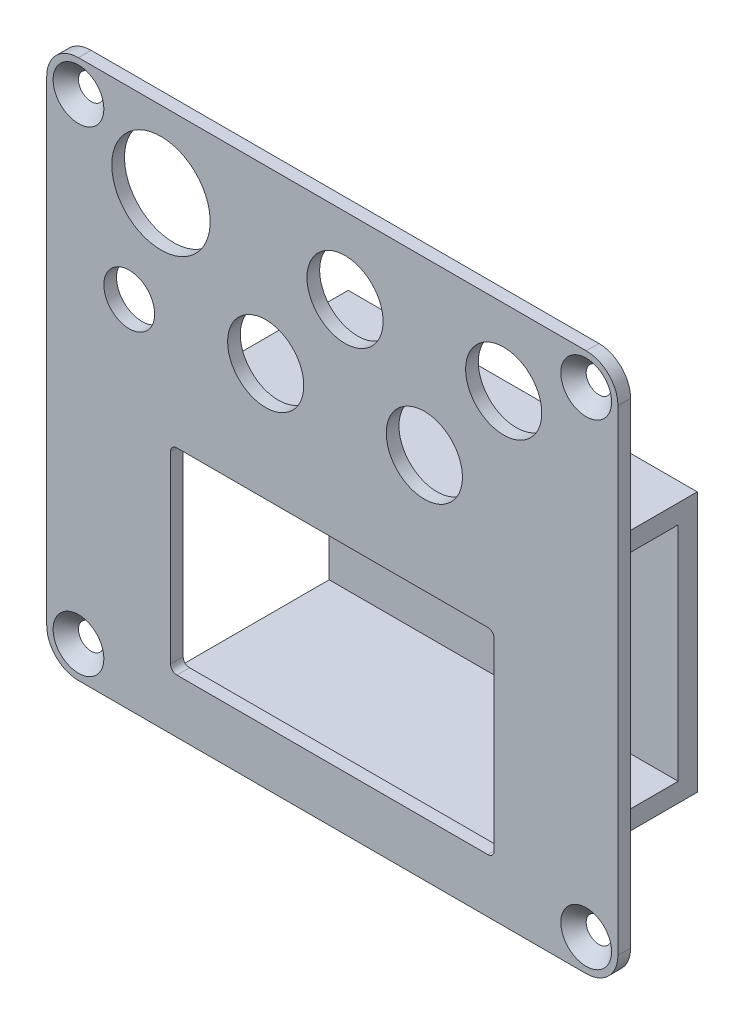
ISO-10303-21;
HEADER;
FILE_DESCRIPTION(('STEP AP214'),'2;1');
FILE_NAME('part.step','',(''),(''),'','','');
FILE_SCHEMA(('AUTOMOTIVE_DESIGN { 1 0 10303 214 1 1 1 1 }'));
ENDSEC;
DATA;
#1=APPLICATION_CONTEXT('core data for automotive mechanical design processes');
#2=APPLICATION_PROTOCOL_DEFINITION('international standard','automotive_design',2000,#1);
#3=PRODUCT_CONTEXT('',#1,'mechanical');
#4=PRODUCT('Part','Part','',(#3));
#5=PRODUCT_RELATED_PRODUCT_CATEGORY('part','',(#4));
#6=PRODUCT_DEFINITION_FORMATION('','',#4);
#7=PRODUCT_DEFINITION_CONTEXT('part definition',#1,'design');
#8=PRODUCT_DEFINITION('design','',#6,#7);
#9=PRODUCT_DEFINITION_SHAPE('','',#8);
#10=(LENGTH_UNIT() NAMED_UNIT(*) SI_UNIT(.MILLI.,.METRE.));
#11=(NAMED_UNIT(*) PLANE_ANGLE_UNIT() SI_UNIT($,.RADIAN.));
#12=(NAMED_UNIT(*) SI_UNIT($,.STERADIAN.) SOLID_ANGLE_UNIT());
#13=UNCERTAINTY_MEASURE_WITH_UNIT(LENGTH_MEASURE(1.E-05),#10,'distance_accuracy_value','');
#14=(GEOMETRIC_REPRESENTATION_CONTEXT(3) GLOBAL_UNCERTAINTY_ASSIGNED_CONTEXT((#13)) GLOBAL_UNIT_ASSIGNED_CONTEXT((#10,
#11,#12)) REPRESENTATION_CONTEXT('',''));
#15=CARTESIAN_POINT('',(0.,0.,0.));
#16=DIRECTION('',(0.,0.,1.));
#17=DIRECTION('',(1.,0.,0.));
#18=AXIS2_PLACEMENT_3D('',#15,#16,#17);
#19=CARTESIAN_POINT('',(40.,-37.5,0.));
#20=DIRECTION('',(0.,0.,1.));
#21=DIRECTION('',(1.,0.,0.));
#22=AXIS2_PLACEMENT_3D('',#19,#20,#21);
#23=PLANE('',#22);
#24=CARTESIAN_POINT('',(-32.,13.5,0.));
#25=DIRECTION('',(0.,0.,-1.));
#26=DIRECTION('',(-1.,0.,0.));
#27=AXIS2_PLACEMENT_3D('',#24,#25,#26);
#28=CIRCLE('',#27,4.);
#29=CARTESIAN_POINT('',(-36.,13.5,0.));
#30=VERTEX_POINT('',#29);
#31=EDGE_CURVE('E651',#30,#30,#28,.T.);
#32=ORIENTED_EDGE('',*,*,#31,.F.);
#33=EDGE_LOOP('',(#32));
#34=FACE_BOUND('',#33,.T.);
#35=CARTESIAN_POINT('',(27.,30.5,0.));
#36=DIRECTION('',(0.,0.,-1.));
#37=DIRECTION('',(-1.,0.,0.));
#38=AXIS2_PLACEMENT_3D('',#35,#36,#37);
#39=CIRCLE('',#38,6.);
#40=CARTESIAN_POINT('',(21.,30.5,0.));
#41=VERTEX_POINT('',#40);
#42=EDGE_CURVE('E647',#41,#41,#39,.T.);
#43=ORIENTED_EDGE('',*,*,#42,.F.);
#44=EDGE_LOOP('',(#43));
#45=FACE_BOUND('',#44,.T.);
#46=CARTESIAN_POINT('',(14.5,15.5,0.));
#47=DIRECTION('',(0.,0.,-1.));
#48=DIRECTION('',(-1.,0.,0.));
#49=AXIS2_PLACEMENT_3D('',#46,#47,#48);
#50=CIRCLE('',#49,6.);
#51=CARTESIAN_POINT('',(8.49999999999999,15.5,0.));
#52=VERTEX_POINT('',#51);
#53=EDGE_CURVE('E643',#52,#52,#50,.T.);
#54=ORIENTED_EDGE('',*,*,#53,.F.);
#55=EDGE_LOOP('',(#54));
#56=FACE_BOUND('',#55,.T.);
#57=CARTESIAN_POINT('',(2.,30.5,0.));
#58=DIRECTION('',(0.,0.,-1.));
#59=DIRECTION('',(-1.,0.,0.));
#60=AXIS2_PLACEMENT_3D('',#57,#58,#59);
#61=CIRCLE('',#60,6.);
#62=CARTESIAN_POINT('',(-4.,30.5,0.));
#63=VERTEX_POINT('',#62);
#64=EDGE_CURVE('E639',#63,#63,#61,.T.);
#65=ORIENTED_EDGE('',*,*,#64,.F.);
#66=EDGE_LOOP('',(#65));
#67=FACE_BOUND('',#66,.T.);
#68=CARTESIAN_POINT('',(-10.5,15.5,0.));
#69=DIRECTION('',(0.,0.,-1.));
#70=DIRECTION('',(-1.,0.,0.));
#71=AXIS2_PLACEMENT_3D('',#68,#69,#70);
#72=CIRCLE('',#71,6.);
#73=CARTESIAN_POINT('',(-16.5,15.5,0.));
#74=VERTEX_POINT('',#73);
#75=EDGE_CURVE('E633',#74,#74,#72,.T.);
#76=ORIENTED_EDGE('',*,*,#75,.F.);
#77=EDGE_LOOP('',(#76));
#78=FACE_BOUND('',#77,.T.);
#79=CARTESIAN_POINT('',(-27.,30.5,0.));
#80=DIRECTION('',(0.,0.,-1.));
#81=DIRECTION('',(-1.,0.,0.));
#82=AXIS2_PLACEMENT_3D('',#79,#80,#81);
#83=CIRCLE('',#82,7.75);
#84=CARTESIAN_POINT('',(-34.75,30.5,0.));
#85=VERTEX_POINT('',#84);
#86=EDGE_CURVE('E232',#85,#85,#83,.T.);
#87=ORIENTED_EDGE('',*,*,#86,.F.);
#88=EDGE_LOOP('',(#87));
#89=FACE_BOUND('',#88,.T.);
#90=DIRECTION('',(1.,0.,0.));
#91=VECTOR('',#90,1.);
#92=CARTESIAN_POINT('',(25.5,-3.,0.));
#93=LINE('',#92,#91);
#94=CARTESIAN_POINT('',(-24.5,-3.,0.));
#95=VERTEX_POINT('',#94);
#96=CARTESIAN_POINT('',(24.5,-3.,0.));
#97=VERTEX_POINT('',#96);
#98=EDGE_CURVE('E255',#95,#97,#93,.T.);
#99=ORIENTED_EDGE('',*,*,#98,.F.);
#100=CARTESIAN_POINT('',(-24.5,-4.,0.));
#101=DIRECTION('',(0.,0.,1.));
#102=DIRECTION('',(1.,0.,0.));
#103=AXIS2_PLACEMENT_3D('',#100,#101,#102);
#104=CIRCLE('',#103,1.);
#105=CARTESIAN_POINT('',(-25.5,-4.,0.));
#106=VERTEX_POINT('',#105);
#107=EDGE_CURVE('E413',#95,#106,#104,.T.);
#108=ORIENTED_EDGE('',*,*,#107,.T.);
#109=DIRECTION('',(0.,1.,0.));
#110=VECTOR('',#109,1.);
#111=CARTESIAN_POINT('',(-25.5,-3.,0.));
#112=LINE('',#111,#110);
#113=CARTESIAN_POINT('',(-25.5,-33.,0.));
#114=VERTEX_POINT('',#113);
#115=EDGE_CURVE('E237',#114,#106,#112,.T.);
#116=ORIENTED_EDGE('',*,*,#115,.F.);
#117=CARTESIAN_POINT('',(-24.5,-33.,0.));
#118=DIRECTION('',(0.,0.,1.));
#119=DIRECTION('',(1.,0.,0.));
#120=AXIS2_PLACEMENT_3D('',#117,#118,#119);
#121=CIRCLE('',#120,1.);
#122=CARTESIAN_POINT('',(-24.5,-34.,0.));
#123=VERTEX_POINT('',#122);
#124=EDGE_CURVE('E409',#114,#123,#121,.T.);
#125=ORIENTED_EDGE('',*,*,#124,.T.);
#126=DIRECTION('',(-1.,0.,0.));
#127=VECTOR('',#126,1.);
#128=CARTESIAN_POINT('',(25.5,-34.,0.));
#129=LINE('',#128,#127);
#130=CARTESIAN_POINT('',(24.5,-34.,0.));
#131=VERTEX_POINT('',#130);
#132=EDGE_CURVE('E244',#131,#123,#129,.T.);
#133=ORIENTED_EDGE('',*,*,#132,.F.);
#134=CARTESIAN_POINT('',(24.5,-33.,0.));
#135=DIRECTION('',(0.,0.,1.));
#136=DIRECTION('',(1.,0.,0.));
#137=AXIS2_PLACEMENT_3D('',#134,#135,#136);
#138=CIRCLE('',#137,1.);
#139=CARTESIAN_POINT('',(25.5,-33.,0.));
#140=VERTEX_POINT('',#139);
#141=EDGE_CURVE('E405',#131,#140,#138,.T.);
#142=ORIENTED_EDGE('',*,*,#141,.T.);
#143=DIRECTION('',(0.,-1.,0.));
#144=VECTOR('',#143,1.);
#145=CARTESIAN_POINT('',(25.5,-3.,0.));
#146=LINE('',#145,#144);
#147=CARTESIAN_POINT('',(25.5,-4.,0.));
#148=VERTEX_POINT('',#147);
#149=EDGE_CURVE('E257',#148,#140,#146,.T.);
#150=ORIENTED_EDGE('',*,*,#149,.F.);
#151=CARTESIAN_POINT('',(24.5,-4.,0.));
#152=DIRECTION('',(0.,0.,1.));
#153=DIRECTION('',(1.,0.,0.));
#154=AXIS2_PLACEMENT_3D('',#151,#152,#153);
#155=CIRCLE('',#154,1.);
#156=EDGE_CURVE('E45',#148,#97,#155,.T.);
#157=ORIENTED_EDGE('',*,*,#156,.T.);
#158=EDGE_LOOP('',(#99,#108,#116,#125,#133,#142,#150,#157));
#159=FACE_BOUND('',#158,.T.);
#160=DIRECTION('',(0.,1.,0.));
#161=VECTOR('',#160,1.);
#162=CARTESIAN_POINT('',(-27.5,-36.,0.));
#163=LINE('',#162,#161);
#164=CARTESIAN_POINT('',(-27.5,-39.,0.));
#165=VERTEX_POINT('',#164);
#166=CARTESIAN_POINT('',(-27.5,-36.,0.));
#167=VERTEX_POINT('',#166);
#168=EDGE_CURVE('E287',#165,#167,#163,.T.);
#169=ORIENTED_EDGE('',*,*,#168,.F.);
#170=DIRECTION('',(-1.,0.,0.));
#171=VECTOR('',#170,1.);
#172=CARTESIAN_POINT('',(27.5,-39.,0.));
#173=LINE('',#172,#171);
#174=CARTESIAN_POINT('',(27.5,-39.,0.));
#175=VERTEX_POINT('',#174);
#176=EDGE_CURVE('E291',#175,#165,#173,.T.);
#177=ORIENTED_EDGE('',*,*,#176,.F.);
#178=DIRECTION('',(0.,-1.,0.));
#179=VECTOR('',#178,1.);
#180=CARTESIAN_POINT('',(27.5,-36.,0.));
#181=LINE('',#180,#179);
#182=CARTESIAN_POINT('',(27.5,-36.,0.));
#183=VERTEX_POINT('',#182);
#184=EDGE_CURVE('E207',#183,#175,#181,.T.);
#185=ORIENTED_EDGE('',*,*,#184,.F.);
#186=DIRECTION('',(1.,0.,0.));
#187=VECTOR('',#186,1.);
#188=CARTESIAN_POINT('',(27.5,-36.,0.));
#189=LINE('',#188,#187);
#190=EDGE_CURVE('E294',#167,#183,#189,.T.);
#191=ORIENTED_EDGE('',*,*,#190,.F.);
#192=EDGE_LOOP('',(#169,#177,#185,#191));
#193=FACE_BOUND('',#192,.T.);
#194=CARTESIAN_POINT('',(-40.,-37.5,0.));
#195=DIRECTION('',(0.,0.,1.));
#196=DIRECTION('',(1.,0.,0.));
#197=AXIS2_PLACEMENT_3D('',#194,#195,#196);
#198=CIRCLE('',#197,2.);
#199=CARTESIAN_POINT('',(-38.,-37.5,0.));
#200=VERTEX_POINT('',#199);
#201=EDGE_CURVE('E304',#200,#200,#198,.T.);
#202=ORIENTED_EDGE('',*,*,#201,.T.);
#203=EDGE_LOOP('',(#202));
#204=FACE_BOUND('',#203,.T.);
#205=CARTESIAN_POINT('',(40.,-37.5,0.));
#206=DIRECTION('',(0.,0.,1.));
#207=DIRECTION('',(1.,0.,0.));
#208=AXIS2_PLACEMENT_3D('',#205,#206,#207);
#209=CIRCLE('',#208,2.);
#210=CARTESIAN_POINT('',(42.,-37.5,0.));
#211=VERTEX_POINT('',#210);
#212=EDGE_CURVE('E309',#211,#211,#209,.T.);
#213=ORIENTED_EDGE('',*,*,#212,.T.);
#214=EDGE_LOOP('',(#213));
#215=FACE_BOUND('',#214,.T.);
#216=CARTESIAN_POINT('',(40.,37.5,0.));
#217=DIRECTION('',(0.,0.,1.));
#218=DIRECTION('',(1.,0.,0.));
#219=AXIS2_PLACEMENT_3D('',#216,#217,#218);
#220=CIRCLE('',#219,2.);
#221=CARTESIAN_POINT('',(42.,37.5,0.));
#222=VERTEX_POINT('',#221);
#223=EDGE_CURVE('E305',#222,#222,#220,.T.);
#224=ORIENTED_EDGE('',*,*,#223,.T.);
#225=EDGE_LOOP('',(#224));
#226=FACE_BOUND('',#225,.T.);
#227=CARTESIAN_POINT('',(-40.,37.5,0.));
#228=DIRECTION('',(0.,0.,1.));
#229=DIRECTION('',(1.,0.,0.));
#230=AXIS2_PLACEMENT_3D('',#227,#228,#229);
#231=CIRCLE('',#230,2.);
#232=CARTESIAN_POINT('',(-38.,37.5,0.));
#233=VERTEX_POINT('',#232);
#234=EDGE_CURVE('E308',#233,#233,#231,.T.);
#235=ORIENTED_EDGE('',*,*,#234,.T.);
#236=EDGE_LOOP('',(#235));
#237=FACE_BOUND('',#236,.T.);
#238=CARTESIAN_POINT('',(40.,-37.5,0.));
#239=DIRECTION('',(0.,0.,1.));
#240=DIRECTION('',(1.,0.,0.));
#241=AXIS2_PLACEMENT_3D('',#238,#239,#240);
#242=CIRCLE('',#241,5.);
#243=CARTESIAN_POINT('',(40.,-42.5,0.));
#244=VERTEX_POINT('',#243);
#245=CARTESIAN_POINT('',(45.,-37.5,0.));
#246=VERTEX_POINT('',#245);
#247=EDGE_CURVE('E316',#244,#246,#242,.T.);
#248=ORIENTED_EDGE('',*,*,#247,.F.);
#249=DIRECTION('',(1.,0.,0.));
#250=VECTOR('',#249,1.);
#251=CARTESIAN_POINT('',(-40.,-42.5,0.));
#252=LINE('',#251,#250);
#253=CARTESIAN_POINT('',(-40.,-42.5,0.));
#254=VERTEX_POINT('',#253);
#255=EDGE_CURVE('E321',#254,#244,#252,.T.);
#256=ORIENTED_EDGE('',*,*,#255,.F.);
#257=CARTESIAN_POINT('',(-40.,-37.5,0.));
#258=DIRECTION('',(0.,0.,1.));
#259=DIRECTION('',(1.,0.,0.));
#260=AXIS2_PLACEMENT_3D('',#257,#258,#259);
#261=CIRCLE('',#260,5.);
#262=CARTESIAN_POINT('',(-45.,-37.5,0.));
#263=VERTEX_POINT('',#262);
#264=EDGE_CURVE('E348',#263,#254,#261,.T.);
#265=ORIENTED_EDGE('',*,*,#264,.F.);
#266=DIRECTION('',(0.,-1.,0.));
#267=VECTOR('',#266,1.);
#268=CARTESIAN_POINT('',(-45.,37.5,0.));
#269=LINE('',#268,#267);
#270=CARTESIAN_POINT('',(-45.,37.5,0.));
#271=VERTEX_POINT('',#270);
#272=EDGE_CURVE('E346',#271,#263,#269,.T.);
#273=ORIENTED_EDGE('',*,*,#272,.F.);
#274=CARTESIAN_POINT('',(-40.,37.5,0.));
#275=DIRECTION('',(0.,0.,1.));
#276=DIRECTION('',(1.,0.,0.));
#277=AXIS2_PLACEMENT_3D('',#274,#275,#276);
#278=CIRCLE('',#277,5.);
#279=CARTESIAN_POINT('',(-40.,42.5,0.));
#280=VERTEX_POINT('',#279);
#281=EDGE_CURVE('E344',#280,#271,#278,.T.);
#282=ORIENTED_EDGE('',*,*,#281,.F.);
#283=DIRECTION('',(-1.,0.,0.));
#284=VECTOR('',#283,1.);
#285=CARTESIAN_POINT('',(-40.,42.5,0.));
#286=LINE('',#285,#284);
#287=CARTESIAN_POINT('',(39.9999999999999,42.5,0.));
#288=VERTEX_POINT('',#287);
#289=EDGE_CURVE('E342',#288,#280,#286,.T.);
#290=ORIENTED_EDGE('',*,*,#289,.F.);
#291=CARTESIAN_POINT('',(40.,37.5,0.));
#292=DIRECTION('',(0.,0.,1.));
#293=DIRECTION('',(-1.,0.,0.));
#294=AXIS2_PLACEMENT_3D('',#291,#292,#293);
#295=CIRCLE('',#294,5.);
#296=CARTESIAN_POINT('',(45.,37.5,0.));
#297=VERTEX_POINT('',#296);
#298=EDGE_CURVE('E340',#297,#288,#295,.T.);
#299=ORIENTED_EDGE('',*,*,#298,.F.);
#300=DIRECTION('',(0.,1.,0.));
#301=VECTOR('',#300,1.);
#302=CARTESIAN_POINT('',(45.,37.5,0.));
#303=LINE('',#302,#301);
#304=EDGE_CURVE('E338',#246,#297,#303,.T.);
#305=ORIENTED_EDGE('',*,*,#304,.F.);
#306=EDGE_LOOP('',(#248,#256,#265,#273,#282,#290,#299,#305));
#307=FACE_BOUND('',#306,.T.);
#308=DIRECTION('',(0.,1.,0.));
#309=VECTOR('',#308,1.);
#310=CARTESIAN_POINT('',(-27.5,2.,0.));
#311=LINE('',#310,#309);
#312=CARTESIAN_POINT('',(-27.5,-1.,0.));
#313=VERTEX_POINT('',#312);
#314=CARTESIAN_POINT('',(-27.5,2.,0.));
#315=VERTEX_POINT('',#314);
#316=EDGE_CURVE('E252',#313,#315,#311,.T.);
#317=ORIENTED_EDGE('',*,*,#316,.F.);
#318=DIRECTION('',(-1.,0.,0.));
#319=VECTOR('',#318,1.);
#320=CARTESIAN_POINT('',(27.5,-1.,0.));
#321=LINE('',#320,#319);
#322=CARTESIAN_POINT('',(27.5,-1.,0.));
#323=VERTEX_POINT('',#322);
#324=EDGE_CURVE('E266',#323,#313,#321,.T.);
#325=ORIENTED_EDGE('',*,*,#324,.F.);
#326=DIRECTION('',(0.,-1.,0.));
#327=VECTOR('',#326,1.);
#328=CARTESIAN_POINT('',(27.5,2.,0.));
#329=LINE('',#328,#327);
#330=CARTESIAN_POINT('',(27.5,1.99999999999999,0.));
#331=VERTEX_POINT('',#330);
#332=EDGE_CURVE('E272',#331,#323,#329,.T.);
#333=ORIENTED_EDGE('',*,*,#332,.F.);
#334=DIRECTION('',(1.,0.,0.));
#335=VECTOR('',#334,1.);
#336=CARTESIAN_POINT('',(27.5,2.,0.));
#337=LINE('',#336,#335);
#338=EDGE_CURVE('E269',#315,#331,#337,.T.);
#339=ORIENTED_EDGE('',*,*,#338,.F.);
#340=EDGE_LOOP('',(#317,#325,#333,#339));
#341=FACE_BOUND('',#340,.T.);
#342=ADVANCED_FACE('F37',(#34,#45,#56,#67,#78,#89,#159,#193,#204,#215,#226,#237,#307,#341),#23,.F.);
#343=CARTESIAN_POINT('',(40.,-37.5,2.));
#344=DIRECTION('',(0.,0.,-1.));
#345=DIRECTION('',(-1.,0.,0.));
#346=AXIS2_PLACEMENT_3D('',#343,#344,#345);
#347=CYLINDRICAL_SURFACE('',#346,5.);
#348=ORIENTED_EDGE('',*,*,#247,.T.);
#349=DIRECTION('',(0.,0.,-1.));
#350=VECTOR('',#349,1.);
#351=CARTESIAN_POINT('',(45.,-37.5,2.));
#352=LINE('',#351,#350);
#353=CARTESIAN_POINT('',(45.,-37.5,2.));
#354=VERTEX_POINT('',#353);
#355=EDGE_CURVE('E371',#354,#246,#352,.T.);
#356=ORIENTED_EDGE('',*,*,#355,.F.);
#357=CARTESIAN_POINT('',(40.,-37.5,2.));
#358=DIRECTION('',(0.,0.,1.));
#359=DIRECTION('',(1.,0.,0.));
#360=AXIS2_PLACEMENT_3D('',#357,#358,#359);
#361=CIRCLE('',#360,5.);
#362=CARTESIAN_POINT('',(40.,-42.5,2.));
#363=VERTEX_POINT('',#362);
#364=EDGE_CURVE('E317',#363,#354,#361,.T.);
#365=ORIENTED_EDGE('',*,*,#364,.F.);
#366=DIRECTION('',(0.,0.,-1.));
#367=VECTOR('',#366,1.);
#368=CARTESIAN_POINT('',(40.,-42.5,2.));
#369=LINE('',#368,#367);
#370=EDGE_CURVE('E335',#363,#244,#369,.T.);
#371=ORIENTED_EDGE('',*,*,#370,.T.);
#372=EDGE_LOOP('',(#348,#356,#365,#371));
#373=FACE_BOUND('',#372,.T.);
#374=ADVANCED_FACE('F458',(#373),#347,.T.);
#375=CARTESIAN_POINT('',(45.,37.5,2.));
#376=DIRECTION('',(-1.,0.,0.));
#377=DIRECTION('',(0.,-1.,0.));
#378=AXIS2_PLACEMENT_3D('',#375,#376,#377);
#379=PLANE('',#378);
#380=ORIENTED_EDGE('',*,*,#304,.T.);
#381=DIRECTION('',(0.,0.,-1.));
#382=VECTOR('',#381,1.);
#383=CARTESIAN_POINT('',(45.,37.5,2.));
#384=LINE('',#383,#382);
#385=CARTESIAN_POINT('',(45.,37.5,2.));
#386=VERTEX_POINT('',#385);
#387=EDGE_CURVE('E368',#386,#297,#384,.T.);
#388=ORIENTED_EDGE('',*,*,#387,.F.);
#389=DIRECTION('',(0.,1.,0.));
#390=VECTOR('',#389,1.);
#391=CARTESIAN_POINT('',(45.,37.5,2.));
#392=LINE('',#391,#390);
#393=EDGE_CURVE('E320',#354,#386,#392,.T.);
#394=ORIENTED_EDGE('',*,*,#393,.F.);
#395=ORIENTED_EDGE('',*,*,#355,.T.);
#396=EDGE_LOOP('',(#380,#388,#394,#395));
#397=FACE_BOUND('',#396,.T.);
#398=ADVANCED_FACE('F464',(#397),#379,.F.);
#399=CARTESIAN_POINT('',(40.,37.5,2.));
#400=DIRECTION('',(0.,0.,-1.));
#401=DIRECTION('',(-1.,0.,0.));
#402=AXIS2_PLACEMENT_3D('',#399,#400,#401);
#403=CYLINDRICAL_SURFACE('',#402,5.);
#404=ORIENTED_EDGE('',*,*,#298,.T.);
#405=DIRECTION('',(0.,0.,-1.));
#406=VECTOR('',#405,1.);
#407=CARTESIAN_POINT('',(39.9999999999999,42.5,2.));
#408=LINE('',#407,#406);
#409=CARTESIAN_POINT('',(39.9999999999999,42.5,2.));
#410=VERTEX_POINT('',#409);
#411=EDGE_CURVE('E365',#410,#288,#408,.T.);
#412=ORIENTED_EDGE('',*,*,#411,.F.);
#413=CARTESIAN_POINT('',(40.,37.5,2.));
#414=DIRECTION('',(0.,0.,1.));
#415=DIRECTION('',(-1.,0.,0.));
#416=AXIS2_PLACEMENT_3D('',#413,#414,#415);
#417=CIRCLE('',#416,5.);
#418=EDGE_CURVE('E323',#386,#410,#417,.T.);
#419=ORIENTED_EDGE('',*,*,#418,.F.);
#420=ORIENTED_EDGE('',*,*,#387,.T.);
#421=EDGE_LOOP('',(#404,#412,#419,#420));
#422=FACE_BOUND('',#421,.T.);
#423=ADVANCED_FACE('F491',(#422),#403,.T.);
#424=CARTESIAN_POINT('',(-40.,42.5,2.));
#425=DIRECTION('',(0.,-1.,0.));
#426=DIRECTION('',(0.,0.,-1.));
#427=AXIS2_PLACEMENT_3D('',#424,#425,#426);
#428=PLANE('',#427);
#429=ORIENTED_EDGE('',*,*,#289,.T.);
#430=DIRECTION('',(0.,0.,-1.));
#431=VECTOR('',#430,1.);
#432=CARTESIAN_POINT('',(-40.,42.5,2.));
#433=LINE('',#432,#431);
#434=CARTESIAN_POINT('',(-40.,42.5,2.));
#435=VERTEX_POINT('',#434);
#436=EDGE_CURVE('E362',#435,#280,#433,.T.);
#437=ORIENTED_EDGE('',*,*,#436,.F.);
#438=DIRECTION('',(-1.,0.,0.));
#439=VECTOR('',#438,1.);
#440=CARTESIAN_POINT('',(-40.,42.5,2.));
#441=LINE('',#440,#439);
#442=EDGE_CURVE('E325',#410,#435,#441,.T.);
#443=ORIENTED_EDGE('',*,*,#442,.F.);
#444=ORIENTED_EDGE('',*,*,#411,.T.);
#445=EDGE_LOOP('',(#429,#437,#443,#444));
#446=FACE_BOUND('',#445,.T.);
#447=ADVANCED_FACE('F487',(#446),#428,.F.);
#448=CARTESIAN_POINT('',(-40.,37.5,2.));
#449=DIRECTION('',(0.,0.,-1.));
#450=DIRECTION('',(-1.,0.,0.));
#451=AXIS2_PLACEMENT_3D('',#448,#449,#450);
#452=CYLINDRICAL_SURFACE('',#451,5.);
#453=ORIENTED_EDGE('',*,*,#281,.T.);
#454=DIRECTION('',(0.,0.,-1.));
#455=VECTOR('',#454,1.);
#456=CARTESIAN_POINT('',(-45.,37.5,2.));
#457=LINE('',#456,#455);
#458=CARTESIAN_POINT('',(-45.,37.5,2.));
#459=VERTEX_POINT('',#458);
#460=EDGE_CURVE('E359',#459,#271,#457,.T.);
#461=ORIENTED_EDGE('',*,*,#460,.F.);
#462=CARTESIAN_POINT('',(-40.,37.5,2.));
#463=DIRECTION('',(0.,0.,1.));
#464=DIRECTION('',(1.,0.,0.));
#465=AXIS2_PLACEMENT_3D('',#462,#463,#464);
#466=CIRCLE('',#465,5.);
#467=EDGE_CURVE('E327',#435,#459,#466,.T.);
#468=ORIENTED_EDGE('',*,*,#467,.F.);
#469=ORIENTED_EDGE('',*,*,#436,.T.);
#470=EDGE_LOOP('',(#453,#461,#468,#469));
#471=FACE_BOUND('',#470,.T.);
#472=ADVANCED_FACE('F483',(#471),#452,.T.);
#473=CARTESIAN_POINT('',(-45.,37.5,2.));
#474=DIRECTION('',(1.,0.,0.));
#475=DIRECTION('',(0.,1.,0.));
#476=AXIS2_PLACEMENT_3D('',#473,#474,#475);
#477=PLANE('',#476);
#478=ORIENTED_EDGE('',*,*,#272,.T.);
#479=DIRECTION('',(0.,0.,-1.));
#480=VECTOR('',#479,1.);
#481=CARTESIAN_POINT('',(-45.,-37.5,2.));
#482=LINE('',#481,#480);
#483=CARTESIAN_POINT('',(-45.,-37.5,2.));
#484=VERTEX_POINT('',#483);
#485=EDGE_CURVE('E356',#484,#263,#482,.T.);
#486=ORIENTED_EDGE('',*,*,#485,.F.);
#487=DIRECTION('',(0.,-1.,0.));
#488=VECTOR('',#487,1.);
#489=CARTESIAN_POINT('',(-45.,37.5,2.));
#490=LINE('',#489,#488);
#491=EDGE_CURVE('E329',#459,#484,#490,.T.);
#492=ORIENTED_EDGE('',*,*,#491,.F.);
#493=ORIENTED_EDGE('',*,*,#460,.T.);
#494=EDGE_LOOP('',(#478,#486,#492,#493));
#495=FACE_BOUND('',#494,.T.);
#496=ADVANCED_FACE('F479',(#495),#477,.F.);
#497=CARTESIAN_POINT('',(-40.,-37.5,2.));
#498=DIRECTION('',(0.,0.,-1.));
#499=DIRECTION('',(-1.,0.,0.));
#500=AXIS2_PLACEMENT_3D('',#497,#498,#499);
#501=CYLINDRICAL_SURFACE('',#500,5.);
#502=ORIENTED_EDGE('',*,*,#264,.T.);
#503=DIRECTION('',(0.,0.,-1.));
#504=VECTOR('',#503,1.);
#505=CARTESIAN_POINT('',(-40.,-42.5,2.));
#506=LINE('',#505,#504);
#507=CARTESIAN_POINT('',(-40.,-42.5,2.));
#508=VERTEX_POINT('',#507);
#509=EDGE_CURVE('E353',#508,#254,#506,.T.);
#510=ORIENTED_EDGE('',*,*,#509,.F.);
#511=CARTESIAN_POINT('',(-40.,-37.5,2.));
#512=DIRECTION('',(0.,0.,1.));
#513=DIRECTION('',(1.,0.,0.));
#514=AXIS2_PLACEMENT_3D('',#511,#512,#513);
#515=CIRCLE('',#514,5.);
#516=EDGE_CURVE('E331',#484,#508,#515,.T.);
#517=ORIENTED_EDGE('',*,*,#516,.F.);
#518=ORIENTED_EDGE('',*,*,#485,.T.);
#519=EDGE_LOOP('',(#502,#510,#517,#518));
#520=FACE_BOUND('',#519,.T.);
#521=ADVANCED_FACE('F475',(#520),#501,.T.);
#522=CARTESIAN_POINT('',(-40.,-42.5,2.));
#523=DIRECTION('',(0.,1.,0.));
#524=DIRECTION('',(0.,0.,1.));
#525=AXIS2_PLACEMENT_3D('',#522,#523,#524);
#526=PLANE('',#525);
#527=ORIENTED_EDGE('',*,*,#255,.T.);
#528=ORIENTED_EDGE('',*,*,#370,.F.);
#529=DIRECTION('',(1.,0.,0.));
#530=VECTOR('',#529,1.);
#531=CARTESIAN_POINT('',(-40.,-42.5,2.));
#532=LINE('',#531,#530);
#533=EDGE_CURVE('E333',#508,#363,#532,.T.);
#534=ORIENTED_EDGE('',*,*,#533,.F.);
#535=ORIENTED_EDGE('',*,*,#509,.T.);
#536=EDGE_LOOP('',(#527,#528,#534,#535));
#537=FACE_BOUND('',#536,.T.);
#538=ADVANCED_FACE('F472',(#537),#526,.F.);
#539=CARTESIAN_POINT('',(40.,-37.5,2.));
#540=DIRECTION('',(0.,0.,1.));
#541=DIRECTION('',(1.,0.,0.));
#542=AXIS2_PLACEMENT_3D('',#539,#540,#541);
#543=PLANE('',#542);
#544=CARTESIAN_POINT('',(-32.,13.5,2.));
#545=DIRECTION('',(0.,0.,-1.));
#546=DIRECTION('',(-1.,0.,0.));
#547=AXIS2_PLACEMENT_3D('',#544,#545,#546);
#548=CIRCLE('',#547,4.);
#549=CARTESIAN_POINT('',(-36.,13.5,2.));
#550=VERTEX_POINT('',#549);
#551=EDGE_CURVE('E613',#550,#550,#548,.T.);
#552=ORIENTED_EDGE('',*,*,#551,.T.);
#553=EDGE_LOOP('',(#552));
#554=FACE_BOUND('',#553,.T.);
#555=CARTESIAN_POINT('',(27.,30.5,2.));
#556=DIRECTION('',(0.,0.,-1.));
#557=DIRECTION('',(-1.,0.,0.));
#558=AXIS2_PLACEMENT_3D('',#555,#556,#557);
#559=CIRCLE('',#558,6.);
#560=CARTESIAN_POINT('',(21.,30.5,2.));
#561=VERTEX_POINT('',#560);
#562=EDGE_CURVE('E239',#561,#561,#559,.T.);
#563=ORIENTED_EDGE('',*,*,#562,.T.);
#564=EDGE_LOOP('',(#563));
#565=FACE_BOUND('',#564,.T.);
#566=CARTESIAN_POINT('',(14.5,15.5,2.));
#567=DIRECTION('',(0.,0.,-1.));
#568=DIRECTION('',(-1.,0.,0.));
#569=AXIS2_PLACEMENT_3D('',#566,#567,#568);
#570=CIRCLE('',#569,6.);
#571=CARTESIAN_POINT('',(8.49999999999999,15.5,2.));
#572=VERTEX_POINT('',#571);
#573=EDGE_CURVE('E620',#572,#572,#570,.T.);
#574=ORIENTED_EDGE('',*,*,#573,.T.);
#575=EDGE_LOOP('',(#574));
#576=FACE_BOUND('',#575,.T.);
#577=CARTESIAN_POINT('',(2.,30.5,2.));
#578=DIRECTION('',(0.,0.,-1.));
#579=DIRECTION('',(-1.,0.,0.));
#580=AXIS2_PLACEMENT_3D('',#577,#578,#579);
#581=CIRCLE('',#580,6.);
#582=CARTESIAN_POINT('',(-4.,30.5,2.));
#583=VERTEX_POINT('',#582);
#584=EDGE_CURVE('E624',#583,#583,#581,.T.);
#585=ORIENTED_EDGE('',*,*,#584,.T.);
#586=EDGE_LOOP('',(#585));
#587=FACE_BOUND('',#586,.T.);
#588=CARTESIAN_POINT('',(-10.5,15.5,2.));
#589=DIRECTION('',(0.,0.,-1.));
#590=DIRECTION('',(-1.,0.,0.));
#591=AXIS2_PLACEMENT_3D('',#588,#589,#590);
#592=CIRCLE('',#591,6.);
#593=CARTESIAN_POINT('',(-16.5,15.5,2.));
#594=VERTEX_POINT('',#593);
#595=EDGE_CURVE('E628',#594,#594,#592,.T.);
#596=ORIENTED_EDGE('',*,*,#595,.T.);
#597=EDGE_LOOP('',(#596));
#598=FACE_BOUND('',#597,.T.);
#599=CARTESIAN_POINT('',(-27.,30.5,2.));
#600=DIRECTION('',(0.,0.,-1.));
#601=DIRECTION('',(-1.,0.,0.));
#602=AXIS2_PLACEMENT_3D('',#599,#600,#601);
#603=CIRCLE('',#602,7.75);
#604=CARTESIAN_POINT('',(-34.75,30.5,2.));
#605=VERTEX_POINT('',#604);
#606=EDGE_CURVE('E631',#605,#605,#603,.T.);
#607=ORIENTED_EDGE('',*,*,#606,.T.);
#608=EDGE_LOOP('',(#607));
#609=FACE_BOUND('',#608,.T.);
#610=DIRECTION('',(-1.,0.,0.));
#611=VECTOR('',#610,1.);
#612=CARTESIAN_POINT('',(25.5,-34.,2.));
#613=LINE('',#612,#611);
#614=CARTESIAN_POINT('',(24.5,-34.,2.));
#615=VERTEX_POINT('',#614);
#616=CARTESIAN_POINT('',(-24.5,-34.,2.));
#617=VERTEX_POINT('',#616);
#618=EDGE_CURVE('E249',#615,#617,#613,.T.);
#619=ORIENTED_EDGE('',*,*,#618,.T.);
#620=CARTESIAN_POINT('',(-24.5,-33.,2.));
#621=DIRECTION('',(0.,0.,1.));
#622=DIRECTION('',(1.,0.,0.));
#623=AXIS2_PLACEMENT_3D('',#620,#621,#622);
#624=CIRCLE('',#623,1.);
#625=CARTESIAN_POINT('',(-25.5,-33.,2.));
#626=VERTEX_POINT('',#625);
#627=EDGE_CURVE('E411',#617,#626,#624,.F.);
#628=ORIENTED_EDGE('',*,*,#627,.T.);
#629=DIRECTION('',(0.,1.,0.));
#630=VECTOR('',#629,1.);
#631=CARTESIAN_POINT('',(-25.5,-3.,2.));
#632=LINE('',#631,#630);
#633=CARTESIAN_POINT('',(-25.5,-4.,2.));
#634=VERTEX_POINT('',#633);
#635=EDGE_CURVE('E241',#626,#634,#632,.T.);
#636=ORIENTED_EDGE('',*,*,#635,.T.);
#637=CARTESIAN_POINT('',(-24.5,-4.,2.));
#638=DIRECTION('',(0.,0.,1.));
#639=DIRECTION('',(1.,0.,0.));
#640=AXIS2_PLACEMENT_3D('',#637,#638,#639);
#641=CIRCLE('',#640,1.);
#642=CARTESIAN_POINT('',(-24.5,-3.,2.));
#643=VERTEX_POINT('',#642);
#644=EDGE_CURVE('E59',#634,#643,#641,.F.);
#645=ORIENTED_EDGE('',*,*,#644,.T.);
#646=DIRECTION('',(1.,0.,0.));
#647=VECTOR('',#646,1.);
#648=CARTESIAN_POINT('',(25.5,-3.,2.));
#649=LINE('',#648,#647);
#650=CARTESIAN_POINT('',(24.5,-3.,2.));
#651=VERTEX_POINT('',#650);
#652=EDGE_CURVE('E243',#643,#651,#649,.T.);
#653=ORIENTED_EDGE('',*,*,#652,.T.);
#654=CARTESIAN_POINT('',(24.5,-4.,2.));
#655=DIRECTION('',(0.,0.,1.));
#656=DIRECTION('',(1.,0.,0.));
#657=AXIS2_PLACEMENT_3D('',#654,#655,#656);
#658=CIRCLE('',#657,1.);
#659=CARTESIAN_POINT('',(25.5,-4.,2.));
#660=VERTEX_POINT('',#659);
#661=EDGE_CURVE('E11',#651,#660,#658,.F.);
#662=ORIENTED_EDGE('',*,*,#661,.T.);
#663=DIRECTION('',(0.,-1.,0.));
#664=VECTOR('',#663,1.);
#665=CARTESIAN_POINT('',(25.5,-3.,2.));
#666=LINE('',#665,#664);
#667=CARTESIAN_POINT('',(25.5,-33.,2.));
#668=VERTEX_POINT('',#667);
#669=EDGE_CURVE('E246',#660,#668,#666,.T.);
#670=ORIENTED_EDGE('',*,*,#669,.T.);
#671=CARTESIAN_POINT('',(24.5,-33.,2.));
#672=DIRECTION('',(0.,0.,1.));
#673=DIRECTION('',(1.,0.,0.));
#674=AXIS2_PLACEMENT_3D('',#671,#672,#673);
#675=CIRCLE('',#674,1.);
#676=EDGE_CURVE('E407',#668,#615,#675,.F.);
#677=ORIENTED_EDGE('',*,*,#676,.T.);
#678=EDGE_LOOP('',(#619,#628,#636,#645,#653,#662,#670,#677));
#679=FACE_BOUND('',#678,.T.);
#680=CARTESIAN_POINT('',(-40.,-37.5,2.));
#681=DIRECTION('',(0.,0.,1.));
#682=DIRECTION('',(1.,0.,0.));
#683=AXIS2_PLACEMENT_3D('',#680,#681,#682);
#684=CIRCLE('',#683,4.);
#685=CARTESIAN_POINT('',(-36.,-37.5,2.));
#686=VERTEX_POINT('',#685);
#687=EDGE_CURVE('E383',#686,#686,#684,.F.);
#688=ORIENTED_EDGE('',*,*,#687,.T.);
#689=EDGE_LOOP('',(#688));
#690=FACE_BOUND('',#689,.T.);
#691=CARTESIAN_POINT('',(40.,-37.5,2.));
#692=DIRECTION('',(0.,0.,1.));
#693=DIRECTION('',(1.,0.,0.));
#694=AXIS2_PLACEMENT_3D('',#691,#692,#693);
#695=CIRCLE('',#694,4.);
#696=CARTESIAN_POINT('',(44.,-37.5,2.));
#697=VERTEX_POINT('',#696);
#698=EDGE_CURVE('E380',#697,#697,#695,.F.);
#699=ORIENTED_EDGE('',*,*,#698,.T.);
#700=EDGE_LOOP('',(#699));
#701=FACE_BOUND('',#700,.T.);
#702=CARTESIAN_POINT('',(40.,37.5,2.));
#703=DIRECTION('',(0.,0.,1.));
#704=DIRECTION('',(1.,0.,0.));
#705=AXIS2_PLACEMENT_3D('',#702,#703,#704);
#706=CIRCLE('',#705,4.);
#707=CARTESIAN_POINT('',(44.,37.5,2.));
#708=VERTEX_POINT('',#707);
#709=EDGE_CURVE('E377',#708,#708,#706,.F.);
#710=ORIENTED_EDGE('',*,*,#709,.T.);
#711=EDGE_LOOP('',(#710));
#712=FACE_BOUND('',#711,.T.);
#713=CARTESIAN_POINT('',(-40.,37.5,2.));
#714=DIRECTION('',(0.,0.,1.));
#715=DIRECTION('',(1.,0.,0.));
#716=AXIS2_PLACEMENT_3D('',#713,#714,#715);
#717=CIRCLE('',#716,4.);
#718=CARTESIAN_POINT('',(-36.,37.5,2.));
#719=VERTEX_POINT('',#718);
#720=EDGE_CURVE('E374',#719,#719,#717,.F.);
#721=ORIENTED_EDGE('',*,*,#720,.T.);
#722=EDGE_LOOP('',(#721));
#723=FACE_BOUND('',#722,.T.);
#724=ORIENTED_EDGE('',*,*,#364,.T.);
#725=ORIENTED_EDGE('',*,*,#393,.T.);
#726=ORIENTED_EDGE('',*,*,#418,.T.);
#727=ORIENTED_EDGE('',*,*,#442,.T.);
#728=ORIENTED_EDGE('',*,*,#467,.T.);
#729=ORIENTED_EDGE('',*,*,#491,.T.);
#730=ORIENTED_EDGE('',*,*,#516,.T.);
#731=ORIENTED_EDGE('',*,*,#533,.T.);
#732=EDGE_LOOP('',(#724,#725,#726,#727,#728,#729,#730,#731));
#733=FACE_BOUND('',#732,.T.);
#734=ADVANCED_FACE('F425',(#554,#565,#576,#587,#598,#609,#679,#690,#701,#712,#723,#733),#543,.T.);
#735=CARTESIAN_POINT('',(-40.,-37.5,0.));
#736=DIRECTION('',(0.,0.,1.));
#737=DIRECTION('',(1.,0.,0.));
#738=AXIS2_PLACEMENT_3D('',#735,#736,#737);
#739=CONICAL_SURFACE('',#738,2.,0.78539816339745);
#740=ORIENTED_EDGE('',*,*,#687,.F.);
#741=EDGE_LOOP('',(#740));
#742=FACE_BOUND('',#741,.T.);
#743=ORIENTED_EDGE('',*,*,#201,.F.);
#744=EDGE_LOOP('',(#743));
#745=FACE_BOUND('',#744,.T.);
#746=ADVANCED_FACE('F500',(#742,#745),#739,.F.);
#747=CARTESIAN_POINT('',(40.,-37.5,0.));
#748=DIRECTION('',(0.,0.,1.));
#749=DIRECTION('',(1.,0.,0.));
#750=AXIS2_PLACEMENT_3D('',#747,#748,#749);
#751=CONICAL_SURFACE('',#750,2.,0.78539816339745);
#752=ORIENTED_EDGE('',*,*,#698,.F.);
#753=EDGE_LOOP('',(#752));
#754=FACE_BOUND('',#753,.T.);
#755=ORIENTED_EDGE('',*,*,#212,.F.);
#756=EDGE_LOOP('',(#755));
#757=FACE_BOUND('',#756,.T.);
#758=ADVANCED_FACE('F506',(#754,#757),#751,.F.);
#759=CARTESIAN_POINT('',(40.,37.5,0.));
#760=DIRECTION('',(0.,0.,1.));
#761=DIRECTION('',(1.,0.,0.));
#762=AXIS2_PLACEMENT_3D('',#759,#760,#761);
#763=CONICAL_SURFACE('',#762,2.,0.78539816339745);
#764=ORIENTED_EDGE('',*,*,#709,.F.);
#765=EDGE_LOOP('',(#764));
#766=FACE_BOUND('',#765,.T.);
#767=ORIENTED_EDGE('',*,*,#223,.F.);
#768=EDGE_LOOP('',(#767));
#769=FACE_BOUND('',#768,.T.);
#770=ADVANCED_FACE('F513',(#766,#769),#763,.F.);
#771=CARTESIAN_POINT('',(-40.,37.5,0.));
#772=DIRECTION('',(0.,0.,1.));
#773=DIRECTION('',(1.,0.,0.));
#774=AXIS2_PLACEMENT_3D('',#771,#772,#773);
#775=CONICAL_SURFACE('',#774,2.,0.78539816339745);
#776=ORIENTED_EDGE('',*,*,#720,.F.);
#777=EDGE_LOOP('',(#776));
#778=FACE_BOUND('',#777,.T.);
#779=ORIENTED_EDGE('',*,*,#234,.F.);
#780=EDGE_LOOP('',(#779));
#781=FACE_BOUND('',#780,.T.);
#782=ADVANCED_FACE('F520',(#778,#781),#775,.F.);
#783=CARTESIAN_POINT('',(-27.5,-36.,-25.));
#784=DIRECTION('',(1.,0.,0.));
#785=DIRECTION('',(0.,0.,-1.));
#786=AXIS2_PLACEMENT_3D('',#783,#784,#785);
#787=PLANE('',#786);
#788=ORIENTED_EDGE('',*,*,#168,.T.);
#789=DIRECTION('',(0.,0.,1.));
#790=VECTOR('',#789,1.);
#791=CARTESIAN_POINT('',(-27.5,-36.,-25.));
#792=LINE('',#791,#790);
#793=CARTESIAN_POINT('',(-27.5,-36.,-25.));
#794=VERTEX_POINT('',#793);
#795=EDGE_CURVE('E301',#794,#167,#792,.T.);
#796=ORIENTED_EDGE('',*,*,#795,.F.);
#797=DIRECTION('',(0.,1.,0.));
#798=VECTOR('',#797,1.);
#799=CARTESIAN_POINT('',(-27.5,2.,-25.));
#800=LINE('',#799,#798);
#801=CARTESIAN_POINT('',(-27.5,-1.,-25.));
#802=VERTEX_POINT('',#801);
#803=EDGE_CURVE('E226',#794,#802,#800,.T.);
#804=ORIENTED_EDGE('',*,*,#803,.T.);
#805=DIRECTION('',(0.,0.,1.));
#806=VECTOR('',#805,1.);
#807=CARTESIAN_POINT('',(-27.5,-1.,-25.));
#808=LINE('',#807,#806);
#809=EDGE_CURVE('E265',#802,#313,#808,.T.);
#810=ORIENTED_EDGE('',*,*,#809,.T.);
#811=ORIENTED_EDGE('',*,*,#316,.T.);
#812=DIRECTION('',(0.,0.,1.));
#813=VECTOR('',#812,1.);
#814=CARTESIAN_POINT('',(-27.5,2.,-25.));
#815=LINE('',#814,#813);
#816=CARTESIAN_POINT('',(-27.5,2.,-28.));
#817=VERTEX_POINT('',#816);
#818=EDGE_CURVE('E284',#817,#315,#815,.T.);
#819=ORIENTED_EDGE('',*,*,#818,.F.);
#820=DIRECTION('',(0.,1.,0.));
#821=VECTOR('',#820,1.);
#822=CARTESIAN_POINT('',(-27.5,2.,-28.));
#823=LINE('',#822,#821);
#824=CARTESIAN_POINT('',(-27.5,-39.,-28.));
#825=VERTEX_POINT('',#824);
#826=EDGE_CURVE('E220',#825,#817,#823,.T.);
#827=ORIENTED_EDGE('',*,*,#826,.F.);
#828=DIRECTION('',(0.,0.,1.));
#829=VECTOR('',#828,1.);
#830=CARTESIAN_POINT('',(-27.5,-39.,-25.));
#831=LINE('',#830,#829);
#832=EDGE_CURVE('E211',#825,#165,#831,.T.);
#833=ORIENTED_EDGE('',*,*,#832,.T.);
#834=EDGE_LOOP('',(#788,#796,#804,#810,#811,#819,#827,#833));
#835=FACE_BOUND('',#834,.T.);
#836=ADVANCED_FACE('F526',(#835),#787,.F.);
#837=CARTESIAN_POINT('',(27.5,-36.,-25.));
#838=DIRECTION('',(0.,-1.,0.));
#839=DIRECTION('',(0.,0.,-1.));
#840=AXIS2_PLACEMENT_3D('',#837,#838,#839);
#841=PLANE('',#840);
#842=ORIENTED_EDGE('',*,*,#190,.T.);
#843=DIRECTION('',(0.,0.,1.));
#844=VECTOR('',#843,1.);
#845=CARTESIAN_POINT('',(27.5,-36.,-25.));
#846=LINE('',#845,#844);
#847=CARTESIAN_POINT('',(27.5,-36.,-25.));
#848=VERTEX_POINT('',#847);
#849=EDGE_CURVE('E210',#848,#183,#846,.T.);
#850=ORIENTED_EDGE('',*,*,#849,.F.);
#851=DIRECTION('',(1.,0.,0.));
#852=VECTOR('',#851,1.);
#853=CARTESIAN_POINT('',(27.5,-36.,-25.));
#854=LINE('',#853,#852);
#855=EDGE_CURVE('E288',#794,#848,#854,.T.);
#856=ORIENTED_EDGE('',*,*,#855,.F.);
#857=ORIENTED_EDGE('',*,*,#795,.T.);
#858=EDGE_LOOP('',(#842,#850,#856,#857));
#859=FACE_BOUND('',#858,.T.);
#860=ADVANCED_FACE('F562',(#859),#841,.F.);
#861=CARTESIAN_POINT('',(27.5,-36.,-25.));
#862=DIRECTION('',(-1.,0.,0.));
#863=DIRECTION('',(0.,0.,1.));
#864=AXIS2_PLACEMENT_3D('',#861,#862,#863);
#865=PLANE('',#864);
#866=ORIENTED_EDGE('',*,*,#184,.T.);
#867=DIRECTION('',(0.,0.,1.));
#868=VECTOR('',#867,1.);
#869=CARTESIAN_POINT('',(27.5,-39.,-25.));
#870=LINE('',#869,#868);
#871=CARTESIAN_POINT('',(27.5,-39.,-28.));
#872=VERTEX_POINT('',#871);
#873=EDGE_CURVE('E200',#872,#175,#870,.T.);
#874=ORIENTED_EDGE('',*,*,#873,.F.);
#875=DIRECTION('',(0.,-1.,0.));
#876=VECTOR('',#875,1.);
#877=CARTESIAN_POINT('',(27.5,2.,-28.));
#878=LINE('',#877,#876);
#879=CARTESIAN_POINT('',(27.5,2.,-28.));
#880=VERTEX_POINT('',#879);
#881=EDGE_CURVE('E205',#880,#872,#878,.T.);
#882=ORIENTED_EDGE('',*,*,#881,.F.);
#883=DIRECTION('',(0.,0.,1.));
#884=VECTOR('',#883,1.);
#885=CARTESIAN_POINT('',(27.5,2.,-25.));
#886=LINE('',#885,#884);
#887=EDGE_CURVE('E282',#880,#331,#886,.T.);
#888=ORIENTED_EDGE('',*,*,#887,.T.);
#889=ORIENTED_EDGE('',*,*,#332,.T.);
#890=DIRECTION('',(0.,0.,1.));
#891=VECTOR('',#890,1.);
#892=CARTESIAN_POINT('',(27.5,-1.,-25.));
#893=LINE('',#892,#891);
#894=CARTESIAN_POINT('',(27.5,-1.,-25.));
#895=VERTEX_POINT('',#894);
#896=EDGE_CURVE('E279',#895,#323,#893,.T.);
#897=ORIENTED_EDGE('',*,*,#896,.F.);
#898=DIRECTION('',(0.,-1.,0.));
#899=VECTOR('',#898,1.);
#900=CARTESIAN_POINT('',(27.5,2.,-25.));
#901=LINE('',#900,#899);
#902=EDGE_CURVE('E229',#895,#848,#901,.T.);
#903=ORIENTED_EDGE('',*,*,#902,.T.);
#904=ORIENTED_EDGE('',*,*,#849,.T.);
#905=EDGE_LOOP('',(#866,#874,#882,#888,#889,#897,#903,#904));
#906=FACE_BOUND('',#905,.T.);
#907=ADVANCED_FACE('F202',(#906),#865,.F.);
#908=CARTESIAN_POINT('',(27.5,-39.,-25.));
#909=DIRECTION('',(0.,1.,0.));
#910=DIRECTION('',(0.,0.,1.));
#911=AXIS2_PLACEMENT_3D('',#908,#909,#910);
#912=PLANE('',#911);
#913=ORIENTED_EDGE('',*,*,#176,.T.);
#914=ORIENTED_EDGE('',*,*,#832,.F.);
#915=DIRECTION('',(-1.,0.,0.));
#916=VECTOR('',#915,1.);
#917=CARTESIAN_POINT('',(27.5,-39.,-28.));
#918=LINE('',#917,#916);
#919=EDGE_CURVE('E214',#872,#825,#918,.T.);
#920=ORIENTED_EDGE('',*,*,#919,.F.);
#921=ORIENTED_EDGE('',*,*,#873,.T.);
#922=EDGE_LOOP('',(#913,#914,#920,#921));
#923=FACE_BOUND('',#922,.T.);
#924=ADVANCED_FACE('F215',(#923),#912,.F.);
#925=CARTESIAN_POINT('',(27.5,2.,-25.));
#926=DIRECTION('',(0.,-1.,0.));
#927=DIRECTION('',(1.,0.,0.));
#928=AXIS2_PLACEMENT_3D('',#925,#926,#927);
#929=PLANE('',#928);
#930=ORIENTED_EDGE('',*,*,#338,.T.);
#931=ORIENTED_EDGE('',*,*,#887,.F.);
#932=DIRECTION('',(1.,0.,0.));
#933=VECTOR('',#932,1.);
#934=CARTESIAN_POINT('',(27.5,2.,-28.));
#935=LINE('',#934,#933);
#936=EDGE_CURVE('E225',#817,#880,#935,.T.);
#937=ORIENTED_EDGE('',*,*,#936,.F.);
#938=ORIENTED_EDGE('',*,*,#818,.T.);
#939=EDGE_LOOP('',(#930,#931,#937,#938));
#940=FACE_BOUND('',#939,.T.);
#941=ADVANCED_FACE('F553',(#940),#929,.F.);
#942=CARTESIAN_POINT('',(27.5,-1.,-25.));
#943=DIRECTION('',(0.,1.,0.));
#944=DIRECTION('',(0.,0.,1.));
#945=AXIS2_PLACEMENT_3D('',#942,#943,#944);
#946=PLANE('',#945);
#947=ORIENTED_EDGE('',*,*,#324,.T.);
#948=ORIENTED_EDGE('',*,*,#809,.F.);
#949=DIRECTION('',(-1.,0.,0.));
#950=VECTOR('',#949,1.);
#951=CARTESIAN_POINT('',(27.5,-1.,-25.));
#952=LINE('',#951,#950);
#953=EDGE_CURVE('E262',#895,#802,#952,.T.);
#954=ORIENTED_EDGE('',*,*,#953,.F.);
#955=ORIENTED_EDGE('',*,*,#896,.T.);
#956=EDGE_LOOP('',(#947,#948,#954,#955));
#957=FACE_BOUND('',#956,.T.);
#958=ADVANCED_FACE('F550',(#957),#946,.F.);
#959=CARTESIAN_POINT('',(-25.5,-3.,2.));
#960=DIRECTION('',(-1.,0.,0.));
#961=DIRECTION('',(0.,-1.,0.));
#962=AXIS2_PLACEMENT_3D('',#959,#960,#961);
#963=PLANE('',#962);
#964=ORIENTED_EDGE('',*,*,#635,.F.);
#965=DIRECTION('',(0.,0.,-1.));
#966=VECTOR('',#965,1.);
#967=CARTESIAN_POINT('',(-25.5,-33.,0.));
#968=LINE('',#967,#966);
#969=EDGE_CURVE('E398',#626,#114,#968,.T.);
#970=ORIENTED_EDGE('',*,*,#969,.T.);
#971=ORIENTED_EDGE('',*,*,#115,.T.);
#972=DIRECTION('',(0.,0.,-1.));
#973=VECTOR('',#972,1.);
#974=CARTESIAN_POINT('',(-25.5,-4.,2.));
#975=LINE('',#974,#973);
#976=EDGE_CURVE('E396',#106,#634,#975,.F.);
#977=ORIENTED_EDGE('',*,*,#976,.T.);
#978=EDGE_LOOP('',(#964,#970,#971,#977));
#979=FACE_BOUND('',#978,.T.);
#980=ADVANCED_FACE('F445',(#979),#963,.F.);
#981=CARTESIAN_POINT('',(25.5,-34.,2.));
#982=DIRECTION('',(0.,-1.,0.));
#983=DIRECTION('',(0.,0.,-1.));
#984=AXIS2_PLACEMENT_3D('',#981,#982,#983);
#985=PLANE('',#984);
#986=ORIENTED_EDGE('',*,*,#618,.F.);
#987=DIRECTION('',(0.,0.,-1.));
#988=VECTOR('',#987,1.);
#989=CARTESIAN_POINT('',(24.5,-34.,0.));
#990=LINE('',#989,#988);
#991=EDGE_CURVE('E388',#615,#131,#990,.T.);
#992=ORIENTED_EDGE('',*,*,#991,.T.);
#993=ORIENTED_EDGE('',*,*,#132,.T.);
#994=DIRECTION('',(0.,0.,-1.));
#995=VECTOR('',#994,1.);
#996=CARTESIAN_POINT('',(-24.5,-34.,2.));
#997=LINE('',#996,#995);
#998=EDGE_CURVE('E386',#123,#617,#997,.F.);
#999=ORIENTED_EDGE('',*,*,#998,.T.);
#1000=EDGE_LOOP('',(#986,#992,#993,#999));
#1001=FACE_BOUND('',#1000,.T.);
#1002=ADVANCED_FACE('F437',(#1001),#985,.F.);
#1003=CARTESIAN_POINT('',(25.5,-3.,2.));
#1004=DIRECTION('',(1.,0.,0.));
#1005=DIRECTION('',(0.,1.,0.));
#1006=AXIS2_PLACEMENT_3D('',#1003,#1004,#1005);
#1007=PLANE('',#1006);
#1008=ORIENTED_EDGE('',*,*,#149,.T.);
#1009=DIRECTION('',(0.,0.,-1.));
#1010=VECTOR('',#1009,1.);
#1011=CARTESIAN_POINT('',(25.5,-33.,2.));
#1012=LINE('',#1011,#1010);
#1013=EDGE_CURVE('E394',#140,#668,#1012,.F.);
#1014=ORIENTED_EDGE('',*,*,#1013,.T.);
#1015=ORIENTED_EDGE('',*,*,#669,.F.);
#1016=DIRECTION('',(0.,0.,-1.));
#1017=VECTOR('',#1016,1.);
#1018=CARTESIAN_POINT('',(25.5,-4.,0.));
#1019=LINE('',#1018,#1017);
#1020=EDGE_CURVE('E391',#660,#148,#1019,.T.);
#1021=ORIENTED_EDGE('',*,*,#1020,.T.);
#1022=EDGE_LOOP('',(#1008,#1014,#1015,#1021));
#1023=FACE_BOUND('',#1022,.T.);
#1024=ADVANCED_FACE('F429',(#1023),#1007,.F.);
#1025=CARTESIAN_POINT('',(25.5,-3.,2.));
#1026=DIRECTION('',(0.,1.,0.));
#1027=DIRECTION('',(0.,0.,1.));
#1028=AXIS2_PLACEMENT_3D('',#1025,#1026,#1027);
#1029=PLANE('',#1028);
#1030=ORIENTED_EDGE('',*,*,#652,.F.);
#1031=DIRECTION('',(0.,0.,-1.));
#1032=VECTOR('',#1031,1.);
#1033=CARTESIAN_POINT('',(-24.5,-3.,0.));
#1034=LINE('',#1033,#1032);
#1035=EDGE_CURVE('E402',#643,#95,#1034,.T.);
#1036=ORIENTED_EDGE('',*,*,#1035,.T.);
#1037=ORIENTED_EDGE('',*,*,#98,.T.);
#1038=DIRECTION('',(0.,0.,-1.));
#1039=VECTOR('',#1038,1.);
#1040=CARTESIAN_POINT('',(24.5,-3.,2.));
#1041=LINE('',#1040,#1039);
#1042=EDGE_CURVE('E52',#97,#651,#1041,.F.);
#1043=ORIENTED_EDGE('',*,*,#1042,.T.);
#1044=EDGE_LOOP('',(#1030,#1036,#1037,#1043));
#1045=FACE_BOUND('',#1044,.T.);
#1046=ADVANCED_FACE('F421',(#1045),#1029,.F.);
#1047=CARTESIAN_POINT('',(0.,0.,-25.));
#1048=DIRECTION('',(0.,0.,-1.));
#1049=DIRECTION('',(-1.,0.,0.));
#1050=AXIS2_PLACEMENT_3D('',#1047,#1048,#1049);
#1051=PLANE('',#1050);
#1052=ORIENTED_EDGE('',*,*,#803,.F.);
#1053=ORIENTED_EDGE('',*,*,#855,.T.);
#1054=ORIENTED_EDGE('',*,*,#902,.F.);
#1055=ORIENTED_EDGE('',*,*,#953,.T.);
#1056=EDGE_LOOP('',(#1052,#1053,#1054,#1055));
#1057=FACE_BOUND('',#1056,.T.);
#1058=ADVANCED_FACE('F532',(#1057),#1051,.F.);
#1059=CARTESIAN_POINT('',(0.,0.,-28.));
#1060=DIRECTION('',(0.,0.,-1.));
#1061=DIRECTION('',(-1.,0.,0.));
#1062=AXIS2_PLACEMENT_3D('',#1059,#1060,#1061);
#1063=PLANE('',#1062);
#1064=ORIENTED_EDGE('',*,*,#881,.T.);
#1065=ORIENTED_EDGE('',*,*,#919,.T.);
#1066=ORIENTED_EDGE('',*,*,#826,.T.);
#1067=ORIENTED_EDGE('',*,*,#936,.T.);
#1068=EDGE_LOOP('',(#1064,#1065,#1066,#1067));
#1069=FACE_BOUND('',#1068,.T.);
#1070=ADVANCED_FACE('F223',(#1069),#1063,.T.);
#1071=CARTESIAN_POINT('',(24.5,-33.,2.));
#1072=DIRECTION('',(0.,0.,1.));
#1073=DIRECTION('',(1.,0.,0.));
#1074=AXIS2_PLACEMENT_3D('',#1071,#1072,#1073);
#1075=CYLINDRICAL_SURFACE('',#1074,1.);
#1076=ORIENTED_EDGE('',*,*,#676,.F.);
#1077=ORIENTED_EDGE('',*,*,#1013,.F.);
#1078=ORIENTED_EDGE('',*,*,#141,.F.);
#1079=ORIENTED_EDGE('',*,*,#991,.F.);
#1080=EDGE_LOOP('',(#1076,#1077,#1078,#1079));
#1081=FACE_BOUND('',#1080,.T.);
#1082=ADVANCED_FACE('F432',(#1081),#1075,.F.);
#1083=CARTESIAN_POINT('',(-24.5,-33.,2.));
#1084=DIRECTION('',(0.,0.,1.));
#1085=DIRECTION('',(1.,0.,0.));
#1086=AXIS2_PLACEMENT_3D('',#1083,#1084,#1085);
#1087=CYLINDRICAL_SURFACE('',#1086,1.);
#1088=ORIENTED_EDGE('',*,*,#627,.F.);
#1089=ORIENTED_EDGE('',*,*,#998,.F.);
#1090=ORIENTED_EDGE('',*,*,#124,.F.);
#1091=ORIENTED_EDGE('',*,*,#969,.F.);
#1092=EDGE_LOOP('',(#1088,#1089,#1090,#1091));
#1093=FACE_BOUND('',#1092,.T.);
#1094=ADVANCED_FACE('F441',(#1093),#1087,.F.);
#1095=CARTESIAN_POINT('',(-24.5,-4.,2.));
#1096=DIRECTION('',(0.,0.,1.));
#1097=DIRECTION('',(1.,0.,0.));
#1098=AXIS2_PLACEMENT_3D('',#1095,#1096,#1097);
#1099=CYLINDRICAL_SURFACE('',#1098,1.);
#1100=ORIENTED_EDGE('',*,*,#644,.F.);
#1101=ORIENTED_EDGE('',*,*,#976,.F.);
#1102=ORIENTED_EDGE('',*,*,#107,.F.);
#1103=ORIENTED_EDGE('',*,*,#1035,.F.);
#1104=EDGE_LOOP('',(#1100,#1101,#1102,#1103));
#1105=FACE_BOUND('',#1104,.T.);
#1106=ADVANCED_FACE('F449',(#1105),#1099,.F.);
#1107=CARTESIAN_POINT('',(24.5,-4.,2.));
#1108=DIRECTION('',(0.,0.,1.));
#1109=DIRECTION('',(1.,0.,0.));
#1110=AXIS2_PLACEMENT_3D('',#1107,#1108,#1109);
#1111=CYLINDRICAL_SURFACE('',#1110,1.);
#1112=ORIENTED_EDGE('',*,*,#661,.F.);
#1113=ORIENTED_EDGE('',*,*,#1042,.F.);
#1114=ORIENTED_EDGE('',*,*,#156,.F.);
#1115=ORIENTED_EDGE('',*,*,#1020,.F.);
#1116=EDGE_LOOP('',(#1112,#1113,#1114,#1115));
#1117=FACE_BOUND('',#1116,.T.);
#1118=ADVANCED_FACE('F39',(#1117),#1111,.F.);
#1119=CARTESIAN_POINT('',(-27.,30.5,2.));
#1120=DIRECTION('',(0.,0.,-1.));
#1121=DIRECTION('',(-1.,0.,0.));
#1122=AXIS2_PLACEMENT_3D('',#1119,#1120,#1121);
#1123=CYLINDRICAL_SURFACE('',#1122,7.75);
#1124=ORIENTED_EDGE('',*,*,#606,.F.);
#1125=EDGE_LOOP('',(#1124));
#1126=FACE_BOUND('',#1125,.T.);
#1127=ORIENTED_EDGE('',*,*,#86,.T.);
#1128=EDGE_LOOP('',(#1127));
#1129=FACE_BOUND('',#1128,.T.);
#1130=ADVANCED_FACE('F455',(#1126,#1129),#1123,.F.);
#1131=CARTESIAN_POINT('',(-10.5,15.5,2.));
#1132=DIRECTION('',(0.,0.,-1.));
#1133=DIRECTION('',(-1.,0.,0.));
#1134=AXIS2_PLACEMENT_3D('',#1131,#1132,#1133);
#1135=CYLINDRICAL_SURFACE('',#1134,6.);
#1136=ORIENTED_EDGE('',*,*,#595,.F.);
#1137=EDGE_LOOP('',(#1136));
#1138=FACE_BOUND('',#1137,.T.);
#1139=ORIENTED_EDGE('',*,*,#75,.T.);
#1140=EDGE_LOOP('',(#1139));
#1141=FACE_BOUND('',#1140,.T.);
#1142=ADVANCED_FACE('F672',(#1138,#1141),#1135,.F.);
#1143=CARTESIAN_POINT('',(2.,30.5,2.));
#1144=DIRECTION('',(0.,0.,-1.));
#1145=DIRECTION('',(-1.,0.,0.));
#1146=AXIS2_PLACEMENT_3D('',#1143,#1144,#1145);
#1147=CYLINDRICAL_SURFACE('',#1146,6.);
#1148=ORIENTED_EDGE('',*,*,#584,.F.);
#1149=EDGE_LOOP('',(#1148));
#1150=FACE_BOUND('',#1149,.T.);
#1151=ORIENTED_EDGE('',*,*,#64,.T.);
#1152=EDGE_LOOP('',(#1151));
#1153=FACE_BOUND('',#1152,.T.);
#1154=ADVANCED_FACE('F669',(#1150,#1153),#1147,.F.);
#1155=CARTESIAN_POINT('',(14.5,15.5,2.));
#1156=DIRECTION('',(0.,0.,-1.));
#1157=DIRECTION('',(-1.,0.,0.));
#1158=AXIS2_PLACEMENT_3D('',#1155,#1156,#1157);
#1159=CYLINDRICAL_SURFACE('',#1158,6.);
#1160=ORIENTED_EDGE('',*,*,#573,.F.);
#1161=EDGE_LOOP('',(#1160));
#1162=FACE_BOUND('',#1161,.T.);
#1163=ORIENTED_EDGE('',*,*,#53,.T.);
#1164=EDGE_LOOP('',(#1163));
#1165=FACE_BOUND('',#1164,.T.);
#1166=ADVANCED_FACE('F663',(#1162,#1165),#1159,.F.);
#1167=CARTESIAN_POINT('',(27.,30.5,2.));
#1168=DIRECTION('',(0.,0.,-1.));
#1169=DIRECTION('',(-1.,0.,0.));
#1170=AXIS2_PLACEMENT_3D('',#1167,#1168,#1169);
#1171=CYLINDRICAL_SURFACE('',#1170,6.);
#1172=ORIENTED_EDGE('',*,*,#562,.F.);
#1173=EDGE_LOOP('',(#1172));
#1174=FACE_BOUND('',#1173,.T.);
#1175=ORIENTED_EDGE('',*,*,#42,.T.);
#1176=EDGE_LOOP('',(#1175));
#1177=FACE_BOUND('',#1176,.T.);
#1178=ADVANCED_FACE('F657',(#1174,#1177),#1171,.F.);
#1179=CARTESIAN_POINT('',(-32.,13.5,2.));
#1180=DIRECTION('',(0.,0.,-1.));
#1181=DIRECTION('',(-1.,0.,0.));
#1182=AXIS2_PLACEMENT_3D('',#1179,#1180,#1181);
#1183=CYLINDRICAL_SURFACE('',#1182,4.);
#1184=ORIENTED_EDGE('',*,*,#551,.F.);
#1185=EDGE_LOOP('',(#1184));
#1186=FACE_BOUND('',#1185,.T.);
#1187=ORIENTED_EDGE('',*,*,#31,.T.);
#1188=EDGE_LOOP('',(#1187));
#1189=FACE_BOUND('',#1188,.T.);
#1190=ADVANCED_FACE('F655',(#1186,#1189),#1183,.F.);
#1191=CLOSED_SHELL('',(#342,#374,#398,#423,#447,#472,#496,#521,#538,#734,#746,#758,#770,#782,
#836,#860,#907,#924,#941,#958,#980,#1002,#1024,#1046,#1058,#1070,#1082,#1094,#1106,#1118,#1130,
#1142,#1154,#1166,#1178,#1190));
#1192=MANIFOLD_SOLID_BREP('B2',#1191);
#1193=ADVANCED_BREP_SHAPE_REPRESENTATION('',(#18,#1192),#14);
#1194=SHAPE_DEFINITION_REPRESENTATION(#9,#1193);
ENDSEC;
END-ISO-10303-21;
